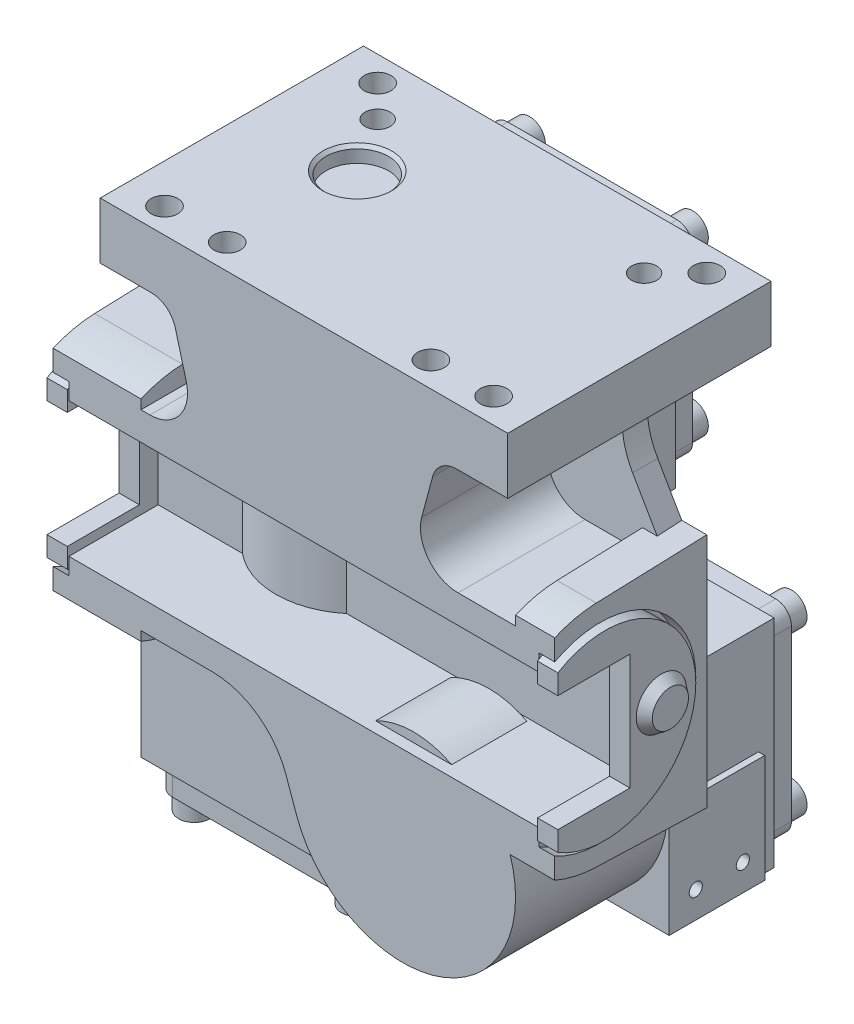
from build123d import *

# Parameters (mm, degrees)
LINEAR_AUSTRAGEN1_DEPTH                = 35.5
LINEAR_AUSTRAGEN1_2_DEPTH              = 35.5
LINEAR_AUSTRAGEN4_DEPTH                = 20
KONTUR_SCHIENENSEITIG_RB40_52_DEPTH    = 48.5
RIPPE_RB40_52_DEPTH                    = 8
SKIZZE10_W                             = 71
SKIZZE10_H                             = 68
LINEAR_AUSTRAGEN5_DEPTH                = 40
SKIZZE11_R                             = 34
LINEAR_AUSTRAGEN6_DEPTH                = 98
LINEAR_AUSTRAGEN7_DEPTH                = 28
LINEAR_START                           = -12.5
LINEAR_AUSTRAGEN8_DEPTH                = 12.5
LINEAR_AUSTRAGEN_RB40_52_REACH         = 176.145
SKIZZE67_W                             = 30.5
SKIZZE67_H                             = 34.5
LINEAR_AUSTRAGEN31_DEPTH               = 2
LINEAR_AUSTRAGEN_RB52_REACH            = 154.218
LINEAR_AUSTRAGEN_FLICK_RB40_RB52_REACH = 154.218
LINEAR_AUSTRAGEN_RB52_2_DEPTH          = 4
LINEAR_AUSTRAGEN34_DEPTH               = 123.352973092
LINEAR_AUSTRAGEN34_DEPTH_BACK          = 123.352973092
SKIZZE72_W                             = 28.5
SKIZZE72_H                             = 43
LINEAR_AUSTRAGEN35_DEPTH               = 8
SKIZZE74_R                             = 5
LINEAR_AUSTRAGEN36_DEPTH               = 6
LINEAR_AUSTRAGEN37_DEPTH               = 8
SKIZZE77_R                             = 5
LINEAR_AUSTRAGEN38_DEPTH               = 6
LINEAR_START_2                         = 14.5
LINEAR_AUSTRAGEN39_DEPTH               = 24
LINEAR_START_3                         = -23.5
LINEAR_AUSTRAGEN40_DEPTH               = 24
LINEAR_AUSTRAGEN41_DEPTH               = 5
LINEAR_AUSTRAGEN42_DEPTH               = 6.5
SKIZZE84_R                             = 8
LINEAR_AUSTRAGEN44_DEPTH               = 2.9
LINEAR_AUSTRAGEN44_TAPER               = 37.5
SCHNITT_LINEAR_AUSTRAGEN1_DEPTH        = 10
SCHNITT_LINEAR_AUSTRAGEN1_DEPTH_BACK   = 1
M6_GEWINDEBOHRUNG1_D                   = 5
M6_GEWINDEBOHRUNG1_DEPTH               = 11
M6_GEWINDEBOHRUNG1_TIP                 = 1.502151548
GEWINDEBOHRUNG0_D                      = 8.5
GEWINDEBOHRUNG0_DEPTH                  = 27.5
GEWINDEBOHRUNG0_TIP                    = 2.553657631
SKIZZE87_R                             = 10
LINEAR_AUSTRAGEN45_DEPTH               = 5
FASE1_SIZE                             = 1
GEWINDEBOHRUNG1_D                      = 4.2
GEWINDEBOHRUNG1_DEPTH                  = 7.4
GEWINDEBOHRUNG1_TIP                    = 1.2618073
F_12_0_12_DURCHMESSER_BOHRUNG1_D       = 8
F_12_0_12_DURCHMESSER_BOHRUNG1_DEPTH   = 14
F_12_0_12_DURCHMESSER_BOHRUNG1_TIP     = 2.403442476


with BuildPart() as part:
    # Skizze4 → Linear austragen1 (new body)
    with BuildSketch(Plane.XY.offset(-6.5)):
        with BuildLine():
            Line((-65, 64.5), (-34.5, 64.5))
            Line((-34.5, 64.5), (-34.5, 49.54356025))
            ThreePointArc((-34.5, 49.54356025), (-37.25, 44.5), (-34.5, 39.45643975))
            Line((-34.5, 39.45643975), (-34.5, 10))
            Line((-34.5, 10), (34.5, 10))
            Line((34.5, 10), (34.5, 64.5))
            Line((34.5, 64.5), (65, 64.5))
            Line((65, 64.5), (65, 82.5))
            Line((65, 82.5), (-65, 82.5))
            Line((-65, 82.5), (-65, 64.5))
        make_face()
    extrude(amount=-LINEAR_AUSTRAGEN1_DEPTH)



with BuildPart() as body_2:
    # Skizze4 → Linear austragen1 2 (new body)
    with BuildSketch(Plane.XY.offset(-6.5)):
        with BuildLine():
            Line((66, -79), (66, -10))
            Line((66, -10), (-3, -10))
            Line((-3, -10), (-3, -39.45643975))
            ThreePointArc((-3, -39.45643975), (-5.75, -44.5), (-3, -49.54356025))
            Line((-3, -49.54356025), (-3, -79))
            Line((-3, -79), (66, -79))
        make_face()
    extrude(amount=-LINEAR_AUSTRAGEN1_2_DEPTH)


with BuildPart() as part_1:
    add(part.part)

    add(body_2.part)  # Linear austragen4 merges body 2
    # Skizze9 → Linear austragen4 (add)
    with BuildSketch(Plane.XY.offset(-6.5)):
        Polygon((34.5, 10), (34.5, -10), (-3, -10), (-3, -79), (-31.5, -79), (-31.5, 10), align=None)
    extrude(amount=-LINEAR_AUSTRAGEN4_DEPTH)

    # Skizze91 → Kontur_Schienenseitig_RB40_52 (add)
    with BuildSketch(Plane.XY.offset(-6.5)):
        with BuildLine():
            Line((65, 64.5), (65, 82.5))
            Line((65, 82.5), (-65, 82.5))
            Line((-65, 82.5), (-65, 64.5))
            Line((-65, 64.5), (-48.767542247, 64.5))
            ThreePointArc((-48.767542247, 64.5), (-43.897450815, 62.846826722), (-41.040135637, 58.570552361))
            Line((-41.040135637, 58.570552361), (-37.566248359, 45.605828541))
            ThreePointArc((-37.566248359, 45.605828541), (-39.637118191, 35.194862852), (-49.157358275, 30.5))
            Line((-49.157358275, 30.5), (-52, 30.5))
            Line((-52, 30.5), (-52, -30.5))
            Line((-52, -30.5), (-29.314725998, -30.5))
            ThreePointArc((-29.314725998, -30.5), (-14.884409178, -35.085153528), (-5.747309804, -47.158723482))
            Line((-5.747309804, -47.158723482), (-2.437079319, -56.511438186))
            ThreePointArc((-2.437079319, -56.511438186), (44.511428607, -78.0663928), (64.666247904, -30.5))
            Line((64.666247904, -30.5), (67.5, -30.5))
            Line((67.5, -30.5), (67.5, 30.5))
            Line((67.5, 30.5), (49.157358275, 30.5))
            ThreePointArc((49.157358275, 30.5), (39.637118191, 35.194862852), (37.566248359, 45.605828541))
            Line((37.566248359, 45.605828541), (41.040135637, 58.570552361))
            ThreePointArc((41.040135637, 58.570552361), (43.897450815, 62.846826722), (48.767542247, 64.5))
            Line((48.767542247, 64.5), (65, 64.5))
        make_face()
    extrude(amount=KONTUR_SCHIENENSEITIG_RB40_52_DEPTH)

    # Skizze92 → Rippe_RB40_52 (add)
    with BuildSketch(Plane.XY.offset(-6.5)):
        with BuildLine():
            Line((-61, 64.5), (-61, 63.5))
            ThreePointArc((-61, 63.5), (-61.851854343, 57.029523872), (-64.349364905, 51))
            Line((-64.349364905, 51), (-64.926715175, 50))
            Line((-64.926715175, 50), (-76.185045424, 30.5))
            Line((-76.185045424, 30.5), (-52, 30.5))
            Line((-52, 30.5), (-49.157358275, 30.5))
            ThreePointArc((-49.157358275, 30.5), (-39.637118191, 35.194862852), (-37.566248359, 45.605828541))
            Line((-37.566248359, 45.605828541), (-41.040135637, 58.570552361))
            ThreePointArc((-41.040135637, 58.570552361), (-43.897450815, 62.846826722), (-48.767542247, 64.5))
            Line((-48.767542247, 64.5), (-61, 64.5))
        make_face()
        with BuildLine():
            Line((61, 64.5), (61, 63.5))
            ThreePointArc((61, 63.5), (61.851854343, 57.029523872), (64.349364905, 51))
            Line((64.349364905, 51), (67.5, 45.54293994))
            Line((67.5, 45.54293994), (76.185045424, 30.5))
            Line((76.185045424, 30.5), (67.5, 30.5))
            Line((67.5, 30.5), (49.157358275, 30.5))
            ThreePointArc((49.157358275, 30.5), (39.637118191, 35.194862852), (37.566248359, 45.605828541))
            Line((37.566248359, 45.605828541), (41.040135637, 58.570552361))
            ThreePointArc((41.040135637, 58.570552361), (43.897450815, 62.846826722), (48.767542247, 64.5))
            Line((48.767542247, 64.5), (61, 64.5))
        make_face()
    extrude(amount=RIPPE_RB40_52_DEPTH)

    # Skizze10 → Linear austragen5 (add)
    with BuildSketch(Plane(origin=(0, -80, 0), x_dir=(-1, 0, 0), z_dir=(0, 1, 0))):
        with Locations((31, -6.5)):
            Rectangle(SKIZZE10_W, SKIZZE10_H)
    extrude(amount=LINEAR_AUSTRAGEN5_DEPTH)

    # Skizze11 → Linear austragen6 (add)
    with BuildSketch(Plane(origin=(0, -80, 0), x_dir=(-1, 0, 0), z_dir=(0, 1, 0))):
        with Locations((31.5, -6.5)):
            Circle(SKIZZE11_R)
    extrude(amount=LINEAR_AUSTRAGEN6_DEPTH)

    # Skizze13 → Linear austragen7 (add)
    with BuildSketch(Plane.ZY.offset(80)):
        with BuildLine():
            Line((-6.5, -37.70955453), (28.77383163, -36.477765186))
            ThreePointArc((28.77383163, -36.477765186), (35.526566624, -35.606519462), (42, -33.496268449))
            Line((42, -33.496268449), (42, 33.496268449))
            ThreePointArc((42, 33.496268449), (35.526566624, 35.606519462), (28.77383163, 36.477765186))
            Line((28.77383163, 36.477765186), (-6.5, 37.70955453))
            Line((-6.5, 37.70955453), (-6.5, -37.70955453))
        make_face()
    extrude(amount=-LINEAR_AUSTRAGEN7_DEPTH)

    # Skizze14 → Linear austragen8 (add)
    with BuildSketch(Plane(origin=(80, 0, 0), x_dir=(0, 0, -1), z_dir=(1, 0, 0)).offset(LINEAR_START)):
        with BuildLine():
            Line((-42, -33.496268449), (-42, 33.496268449))
            ThreePointArc((-42, 33.496268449), (-35.526566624, 35.606519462), (-28.77383163, 36.477765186))
            Line((-28.77383163, 36.477765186), (6.5, 37.70955453))
            Line((6.5, 37.70955453), (6.5, -37.70955453))
            Line((6.5, -37.70955453), (-28.77383163, -36.477765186))
            ThreePointArc((-28.77383163, -36.477765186), (-35.526566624, -35.606519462), (-42, -33.496268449))
        make_face()
    extrude(amount=LINEAR_AUSTRAGEN8_DEPTH)

    # Skizze93 → Linear austragen_RB40_52 (add, up to next)
    with BuildSketch(Plane.ZY.offset(-67.5), mode=Mode.PRIVATE) as linear_austragen_rb40_52_sk1:
        with BuildLine():
            Line((42, -30.5), (-6.5, -30.5))
            Line((-6.5, -30.5), (-6.5, -37.70955453))
            Line((-6.5, -37.70955453), (28.77383163, -36.477765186))
            ThreePointArc((28.77383163, -36.477765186), (35.526566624, -35.606519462), (42, -33.496268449))
            Line((42, -33.496268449), (42, -30.5))
        make_face()
    linear_austragen_rb40_52_tool1 = extrude(linear_austragen_rb40_52_sk1.sketch, amount=LINEAR_AUSTRAGEN_RB40_52_REACH, mode=Mode.PRIVATE) - part_1.part
    add(linear_austragen_rb40_52_tool1.solids().sort_by_distance((67.5, -33.638566, 15.865885))[0])

    # Skizze67 → Linear austragen31 (add)
    with BuildSketch(Plane(origin=(66, 0, 0), x_dir=(0, 0, -1), z_dir=(1, 0, 0))):
        with Locations((21.75, -61.75)):
            Rectangle(SKIZZE67_W, SKIZZE67_H)
    extrude(amount=LINEAR_AUSTRAGEN31_DEPTH)

    # Skizze94 → Linear austragen_RB52 (add, up to next)
    with BuildSketch(Plane(origin=(0, -40, 0), x_dir=(1, 0, 0), z_dir=(0, 1, 0)), mode=Mode.PRIVATE) as linear_austragen_rb52_sk1:
        with BuildLine():
            Line((-65.5, 6.5), (-66.5, 6.5))
            Line((-66.5, 6.5), (-66.5, -27.5))
            Line((-66.5, -27.5), (-31.5, -27.5))
            ThreePointArc((-31.5, -27.5), (-55.54163056, -17.54163056), (-65.5, 6.5))
        make_face()
    linear_austragen_rb52_tool1 = extrude(linear_austragen_rb52_sk1.sketch, amount=LINEAR_AUSTRAGEN_RB52_REACH, mode=Mode.PRIVATE) - part_1.part
    add(linear_austragen_rb52_tool1.solids().sort_by_distance((-58.881148, -40, 18.771815))[0])

    # Skizze95 → Linear austragen_flick_RB40_RB52 (add, up to next)
    with BuildSketch(Plane(origin=(0, -40, 0), x_dir=(1, 0, 0), z_dir=(0, 1, 0)), mode=Mode.PRIVATE) as linear_austragen_flick_rb40_rb52_sk1:
        with BuildLine():
            Line((-9.699680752, -27.5), (-9.699680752, -19.591111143))
            ThreePointArc((-9.699680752, -19.591111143), (-19.90469446, -25.461678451), (-31.5, -27.5))
            Line((-31.5, -27.5), (-9.699680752, -27.5))
        make_face()
    linear_austragen_flick_rb40_rb52_tool1 = extrude(linear_austragen_flick_rb40_rb52_sk1.sketch, amount=LINEAR_AUSTRAGEN_FLICK_RB40_RB52_REACH, mode=Mode.PRIVATE) - part_1.part
    add(linear_austragen_flick_rb40_rb52_tool1.solids().sort_by_distance((-15.014837, -40, 25.183501))[0])

    # Skizze96 → Linear austragen_RB52_2 (add)
    with BuildSketch(Plane.ZY.offset(66.5)):
        Polygon((27.5, -36.522248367), (-6.5, -37.70955453), (-6.5, -40), (27.5, -40), align=None)
    extrude(amount=LINEAR_AUSTRAGEN_RB52_2_DEPTH)

    # Skizze72 → Linear austragen34 (cut, two sides: drawn at the far end of the back side and taken through both)
    with BuildSketch(Plane(origin=(0, 0, 0), x_dir=(0, 0, -1), z_dir=(1, 0, 0)).offset(-LINEAR_AUSTRAGEN34_DEPTH_BACK)):
        with Locations((-27.75, 0)):
            Rectangle(SKIZZE72_W, SKIZZE72_H)
    extrude(amount=LINEAR_AUSTRAGEN34_DEPTH + LINEAR_AUSTRAGEN34_DEPTH_BACK, mode=Mode.SUBTRACT)

    # Skizze73 → Linear austragen35 (add)
    with BuildSketch(Plane(origin=(0, 0, -42), x_dir=(-1, 0, 0), z_dir=(0, 0, -1))):
        with BuildLine():
            Line((27, 76.5), (-27, 76.5))
            ThreePointArc((-27, 76.5), (-30.535533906, 75.035533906), (-32, 71.5))
            Line((-32, 71.5), (-32, 17.5))
            ThreePointArc((-32, 17.5), (-30.535533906, 13.964466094), (-27, 12.5))
            Line((-27, 12.5), (27, 12.5))
            ThreePointArc((27, 12.5), (30.535533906, 13.964466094), (32, 17.5))
            Line((32, 17.5), (32, 71.5))
            ThreePointArc((32, 71.5), (30.535533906, 75.035533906), (27, 76.5))
        make_face()
        with BuildLine():
            Line((-4.5, -12.5), (-58.5, -12.5))
            ThreePointArc((-58.5, -12.5), (-62.035533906, -13.964466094), (-63.5, -17.5))
            Line((-63.5, -17.5), (-63.5, -71.5))
            ThreePointArc((-63.5, -71.5), (-62.035533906, -75.035533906), (-58.5, -76.5))
            Line((-58.5, -76.5), (-4.5, -76.5))
            ThreePointArc((-4.5, -76.5), (-0.964466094, -75.035533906), (0.5, -71.5))
            Line((0.5, -71.5), (0.5, -17.5))
            ThreePointArc((0.5, -17.5), (-0.964466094, -13.964466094), (-4.5, -12.5))
        make_face()
    extrude(amount=LINEAR_AUSTRAGEN35_DEPTH)

    # Skizze74 → Linear austragen36 (add)
    with BuildSketch(Plane(origin=(0, 0, -50), x_dir=(-1, 0, 0), z_dir=(0, 0, -1))):
        with Locations((26, 70.5)):
            Circle(SKIZZE74_R)
        with Locations((-26, 70.5)):
            Circle(SKIZZE74_R)
        with Locations((-26, 18.5)):
            Circle(SKIZZE74_R)
        with Locations((26, 18.5)):
            Circle(SKIZZE74_R)
        with Locations((-5.5, -70.5)):
            Circle(SKIZZE74_R)
        with Locations((-5.5, -18.5)):
            Circle(SKIZZE74_R)
        with Locations((-57.5, -18.5)):
            Circle(SKIZZE74_R)
        with Locations((-57.5, -70.5)):
            Circle(SKIZZE74_R)
    extrude(amount=LINEAR_AUSTRAGEN36_DEPTH)

    # Skizze76 → Linear austragen37 (add)
    with BuildSketch(Plane.XZ.offset(80)):
        with BuildLine():
            Line((-63.5, 20.5), (-63.5, -33.5))
            ThreePointArc((-63.5, -33.5), (-62.035533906, -37.035533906), (-58.5, -38.5))
            Line((-58.5, -38.5), (-4.5, -38.5))
            ThreePointArc((-4.5, -38.5), (-0.964466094, -37.035533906), (0.5, -33.5))
            Line((0.5, -33.5), (0.5, 20.5))
            ThreePointArc((0.5, 20.5), (-0.964466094, 24.035533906), (-4.5, 25.5))
            Line((-4.5, 25.5), (-58.5, 25.5))
            ThreePointArc((-58.5, 25.5), (-62.035533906, 24.035533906), (-63.5, 20.5))
        make_face()
    extrude(amount=LINEAR_AUSTRAGEN37_DEPTH)

    # Skizze77 → Linear austragen38 (add)
    with BuildSketch(Plane.XZ.offset(88)):
        with Locations(Location((-57.5, 19.5, 0), (0, 0, 270))):
            Circle(SKIZZE77_R)
        with Locations(Location((-5.5, 19.5, 0), (0, 0, 270))):
            Circle(SKIZZE77_R)
        with Locations(Location((-57.5, -32.5, 0), (0, 0, 270))):
            Circle(SKIZZE77_R)
        with Locations(Location((-5.5, -32.5, 0), (0, 0, 270))):
            Circle(SKIZZE77_R)
    extrude(amount=LINEAR_AUSTRAGEN38_DEPTH)

    # Skizze78 → Linear austragen39 (add)
    with BuildSketch(Plane.XY.offset(LINEAR_START_2)):
        with BuildLine():
            Line((-12.124355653, 21.5), (12.124355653, 21.5))
            ThreePointArc((12.124355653, 21.5), (0, 18.5), (-12.124355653, 21.5))
        make_face()
        with BuildLine():
            Line((19.375644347, -21.5), (43.624355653, -21.5))
            ThreePointArc((43.624355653, -21.5), (31.5, -18.5), (19.375644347, -21.5))
        make_face()
    extrude(amount=LINEAR_AUSTRAGEN39_DEPTH)

    # Skizze79 → Linear austragen40 (add)
    with BuildSketch(Plane(origin=(0, 0, 0), x_dir=(1, 0, 0), z_dir=(0, 1, 0)).offset(LINEAR_START_3)):
        with BuildLine():
            Line((-48.113247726, -13.5), (-14.886752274, -13.5))
            ThreePointArc((-14.886752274, -13.5), (-31.5, -19.5), (-48.113247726, -13.5))
        make_face()
    extrude(amount=LINEAR_AUSTRAGEN40_DEPTH)

    # Skizze80 → Linear austragen41 (cut)
    with BuildSketch(Plane(origin=(-80, 0, 0), x_dir=(0, 0, -1), z_dir=(1, 0, 0))):
        with BuildLine():
            Line((-13.5, -21.5), (-42, -21.5))
            Line((-42, -21.5), (-42, -26.83281573))
            ThreePointArc((-42, -26.83281573), (3, 0), (-42, 26.83281573))
            Line((-42, 26.83281573), (-42, 21.5))
            Line((-42, 21.5), (-13.5, 21.5))
            Line((-13.5, 21.5), (-13.5, -21.5))
        make_face()
    linear_austragen41 = extrude(amount=LINEAR_AUSTRAGEN41_DEPTH, mode=Mode.SUBTRACT)

    # Skizze81 → Linear austragen42 (add)
    with BuildSketch(Plane.ZY.offset(75)):
        with BuildLine():
            Line((42.5, 18.5), (42.5, 24.819347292))
            ThreePointArc((42.5, 24.819347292), (-1.5, 0), (42.5, -24.819347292))
            Line((42.5, -24.819347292), (42.5, -18.5))
            Line((42.5, -18.5), (19.5, -18.5))
            Line((19.5, -18.5), (19.5, 18.5))
            Line((19.5, 18.5), (42.5, 18.5))
        make_face()
    linear_austragen42 = extrude(amount=LINEAR_AUSTRAGEN42_DEPTH)

    # Skizze84 → Linear austragen44 (add)
    with BuildSketch(Plane.ZY.offset(81.5)):
        with Locations((9.5, 0)):
            Circle(SKIZZE84_R)
    linear_austragen44 = extrude(amount=LINEAR_AUSTRAGEN44_DEPTH, taper=LINEAR_AUSTRAGEN44_TAPER)

    # Spiegeln1: Linear austragen41, Linear austragen42, Linear austragen44 across plane
    add(linear_austragen41.mirror(Plane(origin=(0, 0, 0), x_dir=(0, 0, 1), z_dir=(1, 0, 0))), mode=Mode.SUBTRACT)
    add(linear_austragen42.mirror(Plane(origin=(0, 0, 0), x_dir=(0, 0, 1), z_dir=(1, 0, 0))))
    add(linear_austragen44.mirror(Plane(origin=(0, 0, 0), x_dir=(0, 0, 1), z_dir=(1, 0, 0))))

    # Skizze109 → Schnitt-Linear austragen1 (cut, two sides: drawn at the far end of the back side and taken through both)
    with BuildSketch(Plane(origin=(0, 0, -6.5), x_dir=(-1, 0, 0), z_dir=(0, 0, -1)).offset(-SCHNITT_LINEAR_AUSTRAGEN1_DEPTH_BACK)):
        with BuildLine():
            Line((60, 25), (60, 47.5))
            ThreePointArc((60, 47.5), (62.196699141, 52.803300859), (67.5, 55))
            Line((67.5, 55), (85, 55))
            Line((85, 55), (85, 12.546317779))
            Line((85, 12.546317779), (65.558857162, 17.755556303))
            ThreePointArc((65.558857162, 17.755556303), (61.549849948, 20.434289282), (60, 25))
        make_face()
    extrude(amount=SCHNITT_LINEAR_AUSTRAGEN1_DEPTH + SCHNITT_LINEAR_AUSTRAGEN1_DEPTH_BACK, mode=Mode.SUBTRACT)

    # M6 Gewindebohrung1
    with Locations(Plane(origin=(0, 0, -5.5), x_dir=(-1, 0, 0), z_dir=(0, 0, -1))):
        with Locations((67.5, 25)):
            Hole(M6_GEWINDEBOHRUNG1_D / 2, depth=M6_GEWINDEBOHRUNG1_DEPTH)
            with Locations((0, 0, -(M6_GEWINDEBOHRUNG1_DEPTH + M6_GEWINDEBOHRUNG1_TIP / 2))):  # 118° drill point
                Cone(0, M6_GEWINDEBOHRUNG1_D / 2, M6_GEWINDEBOHRUNG1_TIP, mode=Mode.SUBTRACT)

    # Gewindebohrung0
    with Locations(Plane(origin=(0, 82.5, 0), x_dir=(-1, 0, 0), z_dir=(0, 1, 0))):
        with Locations((-52.5, 34), (-52.5, -34), (52.5, -34), (52.5, 34), (32.5, 34), (-32.5, 34)):
            Hole(GEWINDEBOHRUNG0_D / 2, depth=GEWINDEBOHRUNG0_DEPTH)
            with Locations((0, 0, -(GEWINDEBOHRUNG0_DEPTH + GEWINDEBOHRUNG0_TIP / 2))):  # 118° drill point
                Cone(0, GEWINDEBOHRUNG0_D / 2, GEWINDEBOHRUNG0_TIP, mode=Mode.SUBTRACT)

    # Skizze87 → Linear austragen45 (cut)
    with BuildSketch(Plane(origin=(0, 82.5, 0), x_dir=(1, 0, 0), z_dir=(0, 1, 0))):
        with Locations(Location((-31.5, 6.5, 0), (0, 0, 270))):
            Circle(SKIZZE87_R)
    extrude(amount=-LINEAR_AUSTRAGEN45_DEPTH, mode=Mode.SUBTRACT)

    # Fase1
    fase1_edges = [part_1.edges().sort_by_distance(p)[0] for p in [
        (-31.5, 82.5, -16.5),
    ]]
    chamfer(fase1_edges, length=FASE1_SIZE)

    # Gewindebohrung1
    with Locations(Plane(origin=(68, 0, 0), x_dir=(0, 0, -1), z_dir=(1, 0, 0))):
        with Locations((15, -70.5), (30, -70.5)):
            Hole(GEWINDEBOHRUNG1_D / 2, depth=GEWINDEBOHRUNG1_DEPTH)
            with Locations((0, 0, -(GEWINDEBOHRUNG1_DEPTH + GEWINDEBOHRUNG1_TIP / 2))):  # 118° drill point
                Cone(0, GEWINDEBOHRUNG1_D / 2, GEWINDEBOHRUNG1_TIP, mode=Mode.SUBTRACT)

    # 12.0 _12_ Durchmesser Bohrung1
    with Locations(Plane(origin=(0, 82.5, 0), x_dir=(-1, 0, 0), z_dir=(0, 1, 0))):
        with Locations((42.5, -24), (-42.5, -24)):
            Hole(F_12_0_12_DURCHMESSER_BOHRUNG1_D / 2, depth=F_12_0_12_DURCHMESSER_BOHRUNG1_DEPTH)
            with Locations((0, 0, -(F_12_0_12_DURCHMESSER_BOHRUNG1_DEPTH + F_12_0_12_DURCHMESSER_BOHRUNG1_TIP / 2))):  # 118° drill point
                Cone(0, F_12_0_12_DURCHMESSER_BOHRUNG1_D / 2, F_12_0_12_DURCHMESSER_BOHRUNG1_TIP, mode=Mode.SUBTRACT)


solid = part_1.part
